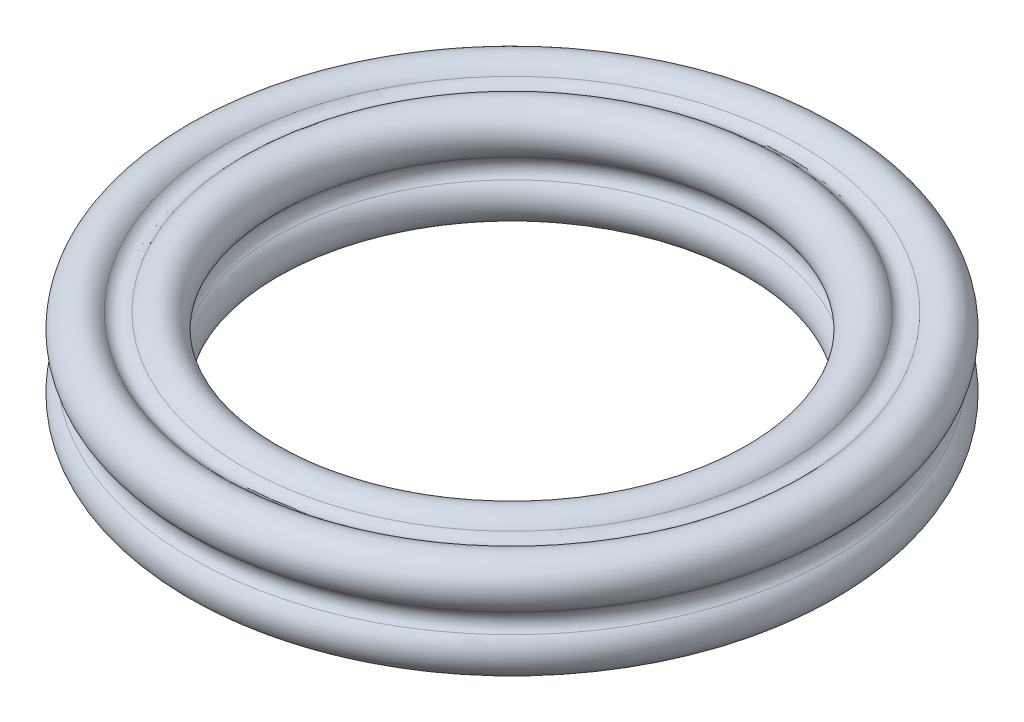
from build123d import *


with BuildPart() as part:
    # Esquisse1 → R_volution1 (revolve)
    with BuildSketch(Plane.XY):
        with BuildLine():
            ThreePointArc((-7.411723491, 2.407275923), (-7.16, 2.290430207), (-6.908276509, 2.407275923))
            ThreePointArc((-6.908276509, 2.407275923), (-6.025735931, 2.444264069), (-6.062724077, 1.561723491))
            ThreePointArc((-6.062724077, 1.561723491), (-6.179569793, 1.31), (-6.062724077, 1.058276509))
            ThreePointArc((-6.062724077, 1.058276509), (-6.025735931, 0.175735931), (-6.908276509, 0.212724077))
            ThreePointArc((-6.908276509, 0.212724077), (-7.16, 0.329569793), (-7.411723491, 0.212724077))
            ThreePointArc((-7.411723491, 0.212724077), (-8.294264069, 0.175735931), (-8.257275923, 1.058276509))
            ThreePointArc((-8.257275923, 1.058276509), (-8.140430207, 1.31), (-8.257275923, 1.561723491))
            ThreePointArc((-8.257275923, 1.561723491), (-8.294264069, 2.444264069), (-7.411723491, 2.407275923))
        make_face()
    revolve(axis=Axis((0, 7.710806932, 0), (0, -1, 0)))


solid = part.part
